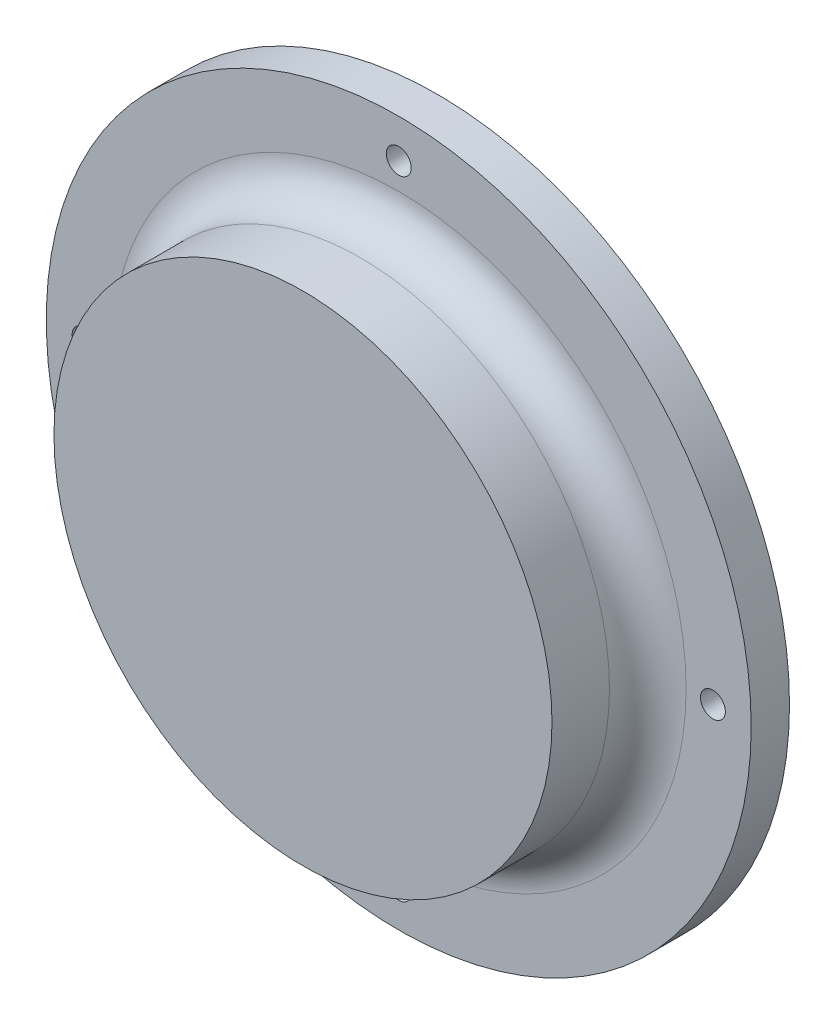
from build123d import *

# Parameters (mm, degrees)
ESQUISSE1_R                   = 92
EMBASE_DEPTH                  = 10
ESQUISSE2_R                   = 3.25
PER_AGES_6_5MM_DEPTH          = 131.491379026
ESQUISSE3_R                   = 65
CORPS_DEPTH                   = 25
CONG_10MM_R                   = 10
ESQUISSE4_R                   = 69
P_N_TRATION_CYLINDRIQUE_DEPTH = 7
CHANFREIN_1_5_SIZE            = 1.5


with BuildPart() as part:
    # Esquisse1 → Embase (new body)
    with BuildSketch(Plane.XY):
        Circle(ESQUISSE1_R)
    extrude(amount=EMBASE_DEPTH)

    # Esquisse2 → per_ages-6_5mm (cut, through all)
    with BuildSketch(Plane.XY.offset(10)):
        with Locations((0, 81.902736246)):
            Circle(ESQUISSE2_R)
        with Locations((-82, 0)):
            Circle(ESQUISSE2_R)
        with Locations((0, -82)):
            Circle(ESQUISSE2_R)
        with Locations((82, 0)):
            Circle(ESQUISSE2_R)
    extrude(amount=-PER_AGES_6_5MM_DEPTH, mode=Mode.SUBTRACT)

    # Esquisse3 → corps (add)
    with BuildSketch(Plane.XY.offset(10)):
        Circle(ESQUISSE3_R)
    extrude(amount=CORPS_DEPTH)

    # Cong_-10mm
    cong_10mm_edges = [part.edges().sort_by_distance(p)[0] for p in [
        (-65, 0, 10),
    ]]
    fillet(cong_10mm_edges, radius=CONG_10MM_R)

    # Esquisse4 → p_n_tration cylindrique (add)
    with BuildSketch(Plane.XY):
        Circle(ESQUISSE4_R)
    extrude(amount=-P_N_TRATION_CYLINDRIQUE_DEPTH)

    # Chanfrein-1.5
    chanfrein_1_5_edges = [part.edges().sort_by_distance(p)[0] for p in [
        (-69, 0, -7),
    ]]
    chamfer(chanfrein_1_5_edges, length=CHANFREIN_1_5_SIZE)


solid = part.part
